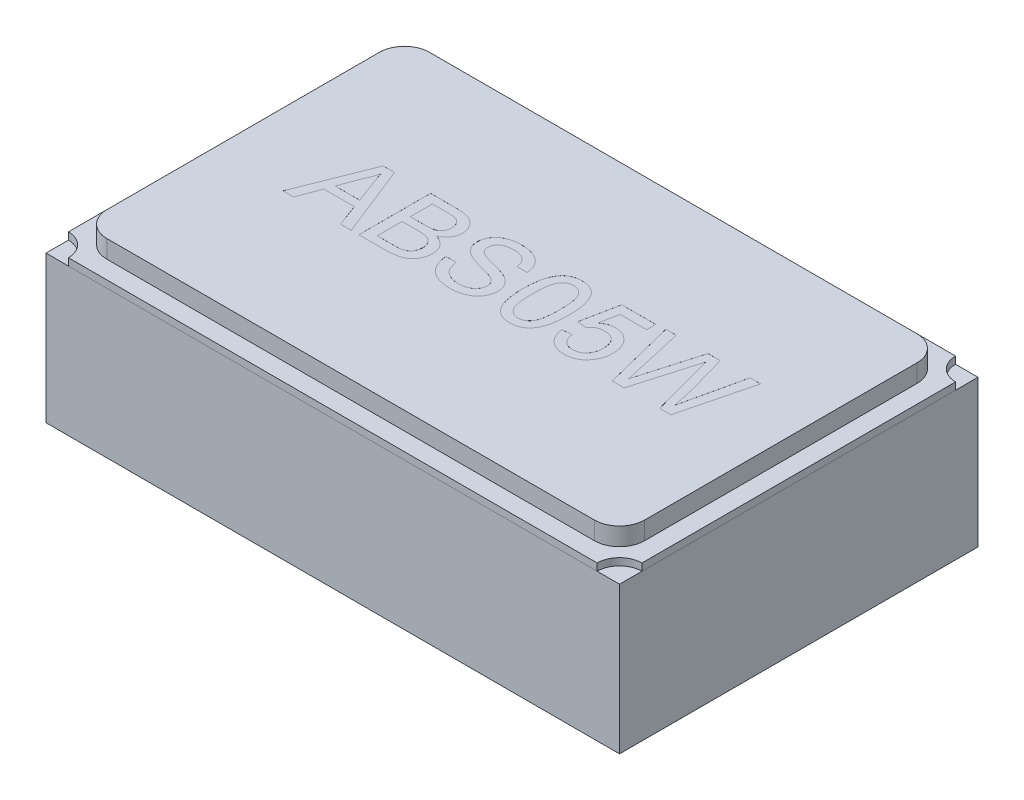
from build123d import *

# Parameters (mm, degrees)
SKETCH1_W           = 1.6
SKETCH1_H           = 1
BOSS_EXTRUDE1_DEPTH = 0.48
CUT_EXTRUDE1_START  = 0.48
SKETCH2_W           = 1.6
SKETCH2_H           = 1
SKETCH2_W_2         = 1.5
SKETCH2_H_2         = 0.9
CUT_EXTRUDE1_DEPTH  = 0.07
FILLET1_R           = 0.07
CUT_EXTRUDE2_START  = 0.48
CUT_EXTRUDE2_DEPTH  = 0.0001
SKETCH3_W           = 0.4
SKETCH3_H           = 0.86
BOSS_EXTRUDE4_DEPTH = 0.02
BOSS_EXTRUDE5_DEPTH = 0.02


with BuildPart() as part:
    # Sketch1 → Boss-Extrude1 (new body)
    with BuildSketch(Plane(origin=(0, 0, 0), x_dir=(1, 0, 0), z_dir=(0, 1, 0))):
        Rectangle(SKETCH1_W, SKETCH1_H)
    extrude(amount=BOSS_EXTRUDE1_DEPTH)

    # Sketch2 → Cut-Extrude1 (cut)
    with BuildSketch(Plane(origin=(0, 0, 0), x_dir=(1, 0, 0), z_dir=(0, 1, 0)).offset(CUT_EXTRUDE1_START)):
        Rectangle(SKETCH2_W, SKETCH2_H)
        Rectangle(SKETCH2_W_2, SKETCH2_H_2, mode=Mode.SUBTRACT)
    extrude(amount=-CUT_EXTRUDE1_DEPTH, mode=Mode.SUBTRACT)

    # Fillet1
    fillet1_edges = [part.edges().sort_by_distance(p)[0] for p in [
        (-0.75, 0.445, 0.45),
        (-0.75, 0.445, -0.45),
        (0.75, 0.445, -0.45),
        (0.75, 0.445, 0.45),
    ]]
    fillet(fillet1_edges, radius=FILLET1_R)

    # Sketch4 → Cut-Extrude2 (cut)
    # profile 1 of 6: a face of its own
    with BuildSketch(Plane(origin=(0, 0, 0), x_dir=(1, 0, 0), z_dir=(0, 1, 0)).offset(CUT_EXTRUDE2_START)):
        Polygon((-0.54989923, -0.089248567), (-0.470492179, 0.110751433), (-0.438681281, 0.110751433), (-0.35927423, -0.089248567), (-0.389202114, -0.089248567), (-0.411958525, -0.027710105), (-0.497214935, -0.027710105), (-0.519971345, -0.089248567), align=None)
        with BuildLine():
            Line((-0.488721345, -0.004633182), (-0.420452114, -0.004633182))
            Line((-0.420452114, -0.004633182), (-0.439883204, 0.047930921))
            add(Edge.make_bspline(
                [(-0.439883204, 0.047930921), (-0.440628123, 0.049961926), (-0.442084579, 0.053932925), (-0.444256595, 0.059702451), (-0.446240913, 0.06518143), (-0.4481867, 0.0702913), (-0.449943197, 0.075106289), (-0.451562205, 0.079593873), (-0.45316339, 0.08372286), (-0.454124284, 0.086390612), (-0.45458673, 0.08767451)],
                knots=[0, 0, 0, 0, 1.225184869, 2.395467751, 3.491410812, 4.525364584, 5.492066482, 6.394148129, 7.227157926, 8, 8, 8, 8], degree=3))
            add(Edge.make_bspline(
                [(-0.45458673, 0.08767451), (-0.455351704, 0.08450853), (-0.456884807, 0.078163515), (-0.460094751, 0.068867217), (-0.463766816, 0.059655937), (-0.46674897, 0.053720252), (-0.468248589, 0.050735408)],
                knots=[0, 0, 0, 0, 0.9891762, 1.982431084, 2.985436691, 4, 4, 4, 4], degree=3))
            Line((-0.468248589, 0.050735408), (-0.488721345, -0.004633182))
        make_face(mode=Mode.SUBTRACT)
    # profile 2 of 6: a face of its own
    with BuildSketch(Plane(origin=(0, 0, 0), x_dir=(1, 0, 0), z_dir=(0, 1, 0)).offset(CUT_EXTRUDE2_START)):
        with BuildLine():
            Line((-0.337920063, -0.089248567), (-0.337920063, 0.110751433))
            Line((-0.337920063, 0.110751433), (-0.263040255, 0.110751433))
            add(Edge.make_bspline(
                [(-0.263040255, 0.110751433), (-0.26118336, 0.11074431), (-0.257560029, 0.11073041), (-0.252269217, 0.110382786), (-0.247258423, 0.109907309), (-0.24251686, 0.109294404), (-0.238065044, 0.108405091), (-0.233907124, 0.107327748), (-0.230021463, 0.106085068), (-0.225271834, 0.104192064), (-0.219798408, 0.101278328), (-0.213935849, 0.096930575), (-0.208835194, 0.091710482), (-0.204638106, 0.08572535), (-0.201180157, 0.079332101), (-0.198728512, 0.072652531), (-0.197161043, 0.065832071), (-0.196983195, 0.061213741), (-0.196894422, 0.058908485)],
                knots=[0, 0, 0, 0, 0.939712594, 1.833646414, 2.682508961, 3.487467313, 4.25240329, 4.978730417, 5.660668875, 6.315918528, 7.564895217, 8.787077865, 9.996481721, 11.241996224, 12.475862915, 13.665015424, 14.834484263, 16, 16, 16, 16], degree=3))
            add(Edge.make_bspline(
                [(-0.196894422, 0.058908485), (-0.196987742, 0.056763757), (-0.197173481, 0.052494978), (-0.198651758, 0.046206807), (-0.200984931, 0.040101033), (-0.204284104, 0.034251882), (-0.20850086, 0.028766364), (-0.213728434, 0.023830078), (-0.219891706, 0.019432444), (-0.224517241, 0.017088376), (-0.226902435, 0.015879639)],
                knots=[0, 0, 0, 0, 0.926741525, 1.844548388, 2.778836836, 3.746021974, 4.738420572, 5.759761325, 6.844803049, 8, 8, 8, 8], degree=3))
            add(Edge.make_bspline(
                [(-0.226902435, 0.015879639), (-0.225426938, 0.015417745), (-0.222538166, 0.014513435), (-0.218385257, 0.012858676), (-0.214486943, 0.010974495), (-0.210834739, 0.008857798), (-0.207453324, 0.006488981), (-0.204352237, 0.003864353), (-0.201509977, 0.001024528), (-0.198931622, -0.002028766), (-0.196666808, -0.00527588), (-0.194635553, -0.008645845), (-0.192958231, -0.012179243), (-0.191583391, -0.015866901), (-0.190510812, -0.019686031), (-0.189740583, -0.023651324), (-0.189301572, -0.027753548), (-0.189235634, -0.030540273), (-0.189202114, -0.0319569)],
                knots=[0, 0, 0, 0, 1.127427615, 2.20731145, 3.257257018, 4.283066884, 5.282973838, 6.264540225, 7.242620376, 8.210460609, 9.17525685, 10.12748095, 11.077310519, 12.023587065, 12.994999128, 13.967387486, 14.966724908, 16, 16, 16, 16], degree=3))
            add(Edge.make_bspline(
                [(-0.189202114, -0.0319569), (-0.189271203, -0.034231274), (-0.189408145, -0.038739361), (-0.190507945, -0.045374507), (-0.192366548, -0.051756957), (-0.194924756, -0.057783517), (-0.197972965, -0.063355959), (-0.201437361, -0.068328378), (-0.205229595, -0.072649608), (-0.209456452, -0.076284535), (-0.214090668, -0.079369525), (-0.219263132, -0.081967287), (-0.224933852, -0.084258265), (-0.231218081, -0.086088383), (-0.23811296, -0.087542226), (-0.245712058, -0.08848679), (-0.25402705, -0.089162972), (-0.259820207, -0.089219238), (-0.262839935, -0.089248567)],
                knots=[0, 0, 0, 0, 1.028073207, 2.037766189, 3.031549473, 4.027532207, 4.992436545, 5.898794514, 6.762903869, 7.584966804, 8.412380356, 9.273953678, 10.198004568, 11.174406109, 12.229717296, 13.381036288, 14.634844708, 16, 16, 16, 16], degree=3))
            Line((-0.262839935, -0.089248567), (-0.337920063, -0.089248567))
        make_face()
        with BuildLine():
            Line((-0.309714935, 0.026136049), (-0.268488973, 0.026136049))
            add(Edge.make_bspline(
                [(-0.268488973, 0.026136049), (-0.267139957, 0.026141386), (-0.264548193, 0.02615164), (-0.260809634, 0.026294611), (-0.257359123, 0.026416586), (-0.254210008, 0.026722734), (-0.251346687, 0.027022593), (-0.248780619, 0.027426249), (-0.246499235, 0.027881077), (-0.245102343, 0.028302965), (-0.244450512, 0.028499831)],
                knots=[0, 0, 0, 0, 1.335841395, 2.566453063, 3.705076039, 4.753984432, 5.69893722, 6.555639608, 7.326018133, 8, 8, 8, 8], degree=3))
            add(Edge.make_bspline(
                [(-0.244450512, 0.028499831), (-0.242918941, 0.02903634), (-0.239966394, 0.030070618), (-0.236009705, 0.032419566), (-0.232639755, 0.035238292), (-0.229865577, 0.038576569), (-0.227733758, 0.04241653), (-0.226153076, 0.046678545), (-0.225287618, 0.051422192), (-0.225163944, 0.054711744), (-0.22509955, 0.05642451)],
                knots=[0, 0, 0, 0, 1.059015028, 2.041559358, 2.989777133, 3.920090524, 4.862499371, 5.848878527, 6.879979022, 8, 8, 8, 8], degree=3))
            add(Edge.make_bspline(
                [(-0.22509955, 0.05642451), (-0.225151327, 0.058070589), (-0.225252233, 0.061278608), (-0.226099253, 0.065937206), (-0.227564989, 0.070271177), (-0.229549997, 0.074279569), (-0.232063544, 0.077845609), (-0.235063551, 0.080911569), (-0.238657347, 0.083229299), (-0.24201647, 0.084675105), (-0.245037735, 0.085579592), (-0.247737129, 0.08611474), (-0.250799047, 0.086586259), (-0.254233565, 0.086987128), (-0.258041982, 0.08729824), (-0.262236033, 0.087545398), (-0.266805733, 0.087650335), (-0.269971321, 0.087666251), (-0.271613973, 0.08767451)],
                knots=[0, 0, 0, 0, 1.216168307, 2.37017178, 3.484610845, 4.588286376, 5.664695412, 6.69777344, 7.738183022, 8.803673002, 9.390844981, 10.0665252, 10.835811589, 11.680682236, 12.621801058, 13.660007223, 14.785756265, 16, 16, 16, 16], degree=3))
            Line((-0.271613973, 0.08767451), (-0.309714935, 0.08767451))
            Line((-0.309714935, 0.08767451), (-0.309714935, 0.026136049))
        make_face(mode=Mode.SUBTRACT)
        with BuildLine():
            Line((-0.309714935, -0.066171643), (-0.26239923, -0.066171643))
            add(Edge.make_bspline(
                [(-0.26239923, -0.066171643), (-0.260516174, -0.06615001), (-0.257056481, -0.066110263), (-0.252324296, -0.065985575), (-0.248499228, -0.065681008), (-0.246265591, -0.065353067), (-0.245291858, -0.065210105)],
                knots=[0, 0, 0, 0, 1.317581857, 2.420761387, 3.311546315, 4, 4, 4, 4], degree=3))
            add(Edge.make_bspline(
                [(-0.245291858, -0.065210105), (-0.243895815, -0.064916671), (-0.241192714, -0.064348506), (-0.23738199, -0.063080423), (-0.233888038, -0.061627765), (-0.230771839, -0.059781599), (-0.227886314, -0.057654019), (-0.225378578, -0.054996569), (-0.223068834, -0.051977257), (-0.221067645, -0.048521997), (-0.219449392, -0.044699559), (-0.21821259, -0.040569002), (-0.217553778, -0.036144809), (-0.217456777, -0.033107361), (-0.217407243, -0.031556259)],
                knots=[0, 0, 0, 0, 1.067651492, 2.067249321, 3.003744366, 3.895862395, 4.774133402, 5.679610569, 6.621910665, 7.616993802, 8.661192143, 9.724711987, 10.838102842, 12, 12, 12, 12], degree=3))
            add(Edge.make_bspline(
                [(-0.217407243, -0.031556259), (-0.21746243, -0.029735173), (-0.21757005, -0.026183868), (-0.218593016, -0.021052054), (-0.220282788, -0.016292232), (-0.222661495, -0.011970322), (-0.225579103, -0.008083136), (-0.229109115, -0.004785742), (-0.233225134, -0.002169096), (-0.237939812, -0.000115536), (-0.243450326, 0.001345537), (-0.24990881, 0.002336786), (-0.25741857, 0.002976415), (-0.262785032, 0.003030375), (-0.265644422, 0.003059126)],
                knots=[0, 0, 0, 0, 0.96167883, 1.875371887, 2.752872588, 3.621584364, 4.472914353, 5.312011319, 6.159851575, 7.038572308, 8.019870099, 9.164119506, 10.488969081, 12, 12, 12, 12], degree=3))
            Line((-0.265644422, 0.003059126), (-0.309714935, 0.003059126))
            Line((-0.309714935, 0.003059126), (-0.309714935, -0.066171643))
        make_face(mode=Mode.SUBTRACT)
    # profile 3 of 6: a face of its own
    with BuildSketch(Plane(origin=(0, 0, 0), x_dir=(1, 0, 0), z_dir=(0, 1, 0)).offset(CUT_EXTRUDE2_START)):
        with BuildLine():
            Line((-0.163561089, -0.020017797), (-0.135355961, -0.020017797))
            add(Edge.make_bspline(
                [(-0.135355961, -0.020017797), (-0.135045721, -0.02255023), (-0.134449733, -0.02741517), (-0.132783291, -0.034310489), (-0.130638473, -0.040510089), (-0.12796609, -0.046096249), (-0.124450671, -0.051001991), (-0.120215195, -0.055426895), (-0.115071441, -0.059258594), (-0.109265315, -0.062668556), (-0.102798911, -0.065345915), (-0.095895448, -0.067330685), (-0.08858785, -0.068506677), (-0.083584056, -0.068658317), (-0.081029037, -0.068735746)],
                knots=[0, 0, 0, 0, 1.125557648, 2.162256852, 3.1243583, 4.018160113, 4.88511607, 5.777380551, 6.711250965, 7.707237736, 8.743031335, 9.791730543, 10.872421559, 12, 12, 12, 12], degree=3))
            add(Edge.make_bspline(
                [(-0.081029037, -0.068735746), (-0.078768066, -0.068693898), (-0.074359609, -0.068612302), (-0.067982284, -0.067632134), (-0.061981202, -0.066241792), (-0.05646805, -0.064138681), (-0.051463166, -0.061584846), (-0.047116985, -0.058495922), (-0.043406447, -0.055012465), (-0.040500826, -0.051042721), (-0.038218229, -0.046883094), (-0.036543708, -0.042607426), (-0.03554623, -0.03823945), (-0.035419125, -0.03530045), (-0.035355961, -0.033839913)],
                knots=[0, 0, 0, 0, 1.267006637, 2.470417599, 3.611360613, 4.716023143, 5.771382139, 6.754486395, 7.697536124, 8.612899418, 9.501261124, 10.352596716, 11.181322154, 12, 12, 12, 12], degree=3))
            add(Edge.make_bspline(
                [(-0.035355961, -0.033839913), (-0.035423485, -0.03239417), (-0.035555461, -0.029568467), (-0.036415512, -0.025454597), (-0.038050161, -0.021689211), (-0.040171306, -0.018118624), (-0.043122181, -0.014854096), (-0.046850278, -0.011846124), (-0.051437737, -0.009119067), (-0.054861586, -0.007625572), (-0.056670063, -0.006836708)],
                knots=[0, 0, 0, 0, 0.942140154, 1.841411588, 2.718743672, 3.605002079, 4.535543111, 5.568170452, 6.715506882, 8, 8, 8, 8], degree=3))
            add(Edge.make_bspline(
                [(-0.056670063, -0.006836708), (-0.057374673, -0.006547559), (-0.058966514, -0.00589432), (-0.061694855, -0.005029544), (-0.064932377, -0.0039113), (-0.068756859, -0.002759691), (-0.073147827, -0.00154145), (-0.078097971, -0.000162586), (-0.083604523, 0.001303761), (-0.08951131, 0.002864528), (-0.095475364, 0.004451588), (-0.101173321, 0.006040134), (-0.106415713, 0.007652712), (-0.111245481, 0.009205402), (-0.115637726, 0.010764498), (-0.119604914, 0.012287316), (-0.123151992, 0.013742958), (-0.125318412, 0.01481327), (-0.126341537, 0.015318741)],
                knots=[0, 0, 0, 0, 0.499201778, 1.127787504, 1.87543728, 2.745208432, 3.745951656, 4.863402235, 6.114490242, 7.482339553, 8.869366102, 10.161191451, 11.360587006, 12.46547846, 13.487450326, 14.41601931, 15.251940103, 16, 16, 16, 16], degree=3))
            add(Edge.make_bspline(
                [(-0.126341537, 0.015318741), (-0.128695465, 0.016590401), (-0.133239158, 0.019045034), (-0.139354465, 0.023433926), (-0.144507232, 0.028304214), (-0.14867572, 0.033648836), (-0.151942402, 0.039377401), (-0.154146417, 0.045499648), (-0.155655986, 0.051904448), (-0.155797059, 0.056308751), (-0.155868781, 0.058547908)],
                knots=[0, 0, 0, 0, 1.158441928, 2.236094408, 3.251151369, 4.220012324, 5.163146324, 6.095083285, 7.031536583, 8, 8, 8, 8], degree=3))
            add(Edge.make_bspline(
                [(-0.155868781, 0.058547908), (-0.155773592, 0.061027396), (-0.155584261, 0.065959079), (-0.153904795, 0.073196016), (-0.151226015, 0.080159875), (-0.148176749, 0.085688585), (-0.145203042, 0.089869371), (-0.142737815, 0.092880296), (-0.139972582, 0.095663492), (-0.136992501, 0.098257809), (-0.1337443, 0.100624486), (-0.130308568, 0.102860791), (-0.126560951, 0.104782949), (-0.12129499, 0.107229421), (-0.114250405, 0.109672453), (-0.105382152, 0.111801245), (-0.096048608, 0.113054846), (-0.089686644, 0.11322741), (-0.086437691, 0.113315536)],
                knots=[0, 0, 0, 0, 1.199927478, 2.386647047, 3.578628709, 4.806592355, 5.433127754, 6.062729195, 6.689531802, 7.331674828, 7.974827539, 8.635320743, 9.315455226, 10.01318112, 11.447700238, 12.918145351, 14.426146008, 16, 16, 16, 16], degree=3))
            add(Edge.make_bspline(
                [(-0.086437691, 0.113315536), (-0.082881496, 0.113234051), (-0.0759569, 0.113075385), (-0.065895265, 0.111755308), (-0.056510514, 0.109488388), (-0.04915067, 0.1069508), (-0.043709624, 0.104381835), (-0.039844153, 0.102377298), (-0.036256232, 0.100059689), (-0.032913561, 0.097551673), (-0.029785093, 0.094854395), (-0.026951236, 0.091903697), (-0.024288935, 0.088800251), (-0.021160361, 0.084344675), (-0.017787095, 0.078447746), (-0.014870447, 0.070808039), (-0.012866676, 0.062744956), (-0.012476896, 0.05717074), (-0.012279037, 0.054341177)],
                knots=[0, 0, 0, 0, 1.607600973, 3.130308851, 4.577334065, 5.967726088, 6.640410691, 7.296826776, 7.935019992, 8.569057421, 9.185393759, 9.8003086, 10.417295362, 11.032210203, 12.259799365, 13.477607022, 14.719591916, 16, 16, 16, 16], degree=3))
            Line((-0.012279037, 0.054341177), (-0.040484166, 0.054341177))
            add(Edge.make_bspline(
                [(-0.040484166, 0.054341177), (-0.040663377, 0.055773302), (-0.04101404, 0.058575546), (-0.041883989, 0.062632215), (-0.043103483, 0.066399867), (-0.044531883, 0.069913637), (-0.046263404, 0.073136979), (-0.048281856, 0.076100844), (-0.050611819, 0.078770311), (-0.053193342, 0.08121592), (-0.05610498, 0.083345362), (-0.059331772, 0.085193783), (-0.062879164, 0.086755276), (-0.066744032, 0.088034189), (-0.07092714, 0.089025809), (-0.075438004, 0.089755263), (-0.080274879, 0.090128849), (-0.08360596, 0.09020138), (-0.085315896, 0.090238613)],
                knots=[0, 0, 0, 0, 1.074487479, 2.102453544, 3.083708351, 4.020042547, 4.923259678, 5.803182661, 6.684453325, 7.556870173, 8.445961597, 9.363679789, 10.320905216, 11.327237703, 12.390948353, 13.519046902, 14.726457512, 16, 16, 16, 16], degree=3))
            add(Edge.make_bspline(
                [(-0.085315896, 0.090238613), (-0.087093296, 0.090225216), (-0.090533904, 0.090199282), (-0.095507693, 0.089726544), (-0.100117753, 0.089077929), (-0.104356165, 0.088121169), (-0.108209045, 0.086868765), (-0.111733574, 0.085422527), (-0.114831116, 0.083589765), (-0.117573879, 0.081548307), (-0.11993986, 0.079289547), (-0.121978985, 0.076909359), (-0.123782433, 0.074477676), (-0.125183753, 0.071861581), (-0.126324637, 0.069160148), (-0.127060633, 0.0663226), (-0.127581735, 0.063401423), (-0.12763597, 0.061408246), (-0.127663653, 0.060390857)],
                knots=[0, 0, 0, 0, 1.464176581, 2.834285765, 4.113735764, 5.29917439, 6.409476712, 7.449999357, 8.431575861, 9.367089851, 10.262376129, 11.120706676, 11.948504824, 12.751342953, 13.560717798, 14.359016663, 15.162382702, 16, 16, 16, 16], degree=3))
            add(Edge.make_bspline(
                [(-0.127663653, 0.060390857), (-0.127590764, 0.058670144), (-0.127449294, 0.055330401), (-0.126004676, 0.050585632), (-0.123782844, 0.046260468), (-0.121593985, 0.043907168), (-0.120492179, 0.042722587)],
                knots=[0, 0, 0, 0, 1.050964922, 2.039826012, 3.013306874, 4, 4, 4, 4], degree=3))
            add(Edge.make_bspline(
                [(-0.120492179, 0.042722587), (-0.119797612, 0.04213059), (-0.11826162, 0.040821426), (-0.11540367, 0.0390889), (-0.111860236, 0.037338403), (-0.107607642, 0.035598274), (-0.102653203, 0.033847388), (-0.097004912, 0.032044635), (-0.090641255, 0.030254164), (-0.083756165, 0.028528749), (-0.076800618, 0.026796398), (-0.07019051, 0.025070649), (-0.064121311, 0.023435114), (-0.058602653, 0.021839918), (-0.053628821, 0.020289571), (-0.049217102, 0.018751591), (-0.045331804, 0.017337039), (-0.0429516, 0.016341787), (-0.041846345, 0.015879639)],
                knots=[0, 0, 0, 0, 0.523891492, 1.158553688, 1.913783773, 2.794766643, 3.797521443, 4.933638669, 6.202080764, 7.596537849, 9.013317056, 10.322179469, 11.523240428, 12.626146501, 13.623953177, 14.517289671, 15.311498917, 16, 16, 16, 16], degree=3))
            add(Edge.make_bspline(
                [(-0.041846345, 0.015879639), (-0.040408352, 0.015216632), (-0.037585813, 0.01391526), (-0.033587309, 0.011693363), (-0.02985627, 0.009386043), (-0.026422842, 0.006931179), (-0.023298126, 0.004323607), (-0.020447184, 0.001593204), (-0.017852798, -0.001244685), (-0.015619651, -0.004280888), (-0.013614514, -0.007392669), (-0.011859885, -0.010623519), (-0.010447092, -0.013992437), (-0.009207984, -0.017458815), (-0.00831671, -0.021061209), (-0.007617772, -0.024763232), (-0.007210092, -0.028582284), (-0.007170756, -0.031168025), (-0.007150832, -0.032477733)],
                knots=[0, 0, 0, 0, 1.198900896, 2.353241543, 3.461831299, 4.520043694, 5.547003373, 6.541368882, 7.508191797, 8.454912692, 9.392021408, 10.310662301, 11.235020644, 12.156274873, 13.095836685, 14.042125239, 15.00831306, 16, 16, 16, 16], degree=3))
            add(Edge.make_bspline(
                [(-0.007150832, -0.032477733), (-0.007255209, -0.035091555), (-0.00746243, -0.040280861), (-0.009246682, -0.047930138), (-0.012049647, -0.055342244), (-0.015336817, -0.061224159), (-0.018444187, -0.065717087), (-0.021054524, -0.068946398), (-0.023949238, -0.071932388), (-0.027057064, -0.074768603), (-0.030402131, -0.077397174), (-0.03401264, -0.079818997), (-0.037850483, -0.082059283), (-0.043330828, -0.084789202), (-0.050609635, -0.087644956), (-0.059881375, -0.090023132), (-0.069652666, -0.091565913), (-0.076362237, -0.09172928), (-0.07978705, -0.091812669)],
                knots=[0, 0, 0, 0, 1.197055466, 2.376552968, 3.581957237, 4.820753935, 5.454298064, 6.085440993, 6.72202542, 7.359198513, 8.013298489, 8.67051481, 9.351020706, 10.049282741, 11.476266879, 12.925760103, 14.430794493, 16, 16, 16, 16], degree=3))
            add(Edge.make_bspline(
                [(-0.07978705, -0.091812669), (-0.081964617, -0.091794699), (-0.08623016, -0.091759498), (-0.092497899, -0.0913332), (-0.098504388, -0.090716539), (-0.104243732, -0.089798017), (-0.109697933, -0.088592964), (-0.11488657, -0.08714593), (-0.119821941, -0.085479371), (-0.124486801, -0.083519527), (-0.128868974, -0.081242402), (-0.133047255, -0.078785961), (-0.136953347, -0.076001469), (-0.140595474, -0.072932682), (-0.144065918, -0.069668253), (-0.147220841, -0.066074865), (-0.150167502, -0.062257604), (-0.15283857, -0.058181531), (-0.155224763, -0.053899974), (-0.15737063, -0.049484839), (-0.159178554, -0.044904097), (-0.160635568, -0.040180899), (-0.161869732, -0.035346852), (-0.162725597, -0.030361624), (-0.163354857, -0.025240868), (-0.163491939, -0.021769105), (-0.163561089, -0.020017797)],
                knots=[0, 0, 0, 0, 1.259822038, 2.467811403, 3.633536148, 4.752793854, 5.829021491, 6.863980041, 7.868367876, 8.841470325, 9.788447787, 10.724101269, 11.643985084, 12.560193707, 13.478453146, 14.398077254, 15.323914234, 16.266973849, 17.21495974, 18.158525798, 19.105629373, 20.061269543, 21.017128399, 21.990322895, 22.986232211, 24, 24, 24, 24], degree=3))
        make_face()
    # profile 4 of 6: a face of its own
    with BuildSketch(Plane(origin=(0, 0, 0), x_dir=(1, 0, 0), z_dir=(0, 1, 0)).offset(CUT_EXTRUDE2_START)):
        with BuildLine():
            add(Edge.make_bspline(
                [(0.021054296, 0.009389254), (0.021080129, 0.012247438), (0.021130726, 0.017845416), (0.02144456, 0.026036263), (0.02199249, 0.033814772), (0.022810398, 0.041174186), (0.023778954, 0.048131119), (0.025038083, 0.05467564), (0.026454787, 0.060822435), (0.028154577, 0.066565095), (0.03002209, 0.071952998), (0.032140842, 0.0769775), (0.034524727, 0.081633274), (0.037056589, 0.085968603), (0.039869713, 0.089916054), (0.042794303, 0.09358641), (0.046042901, 0.096845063), (0.049480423, 0.09977586), (0.053157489, 0.102362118), (0.057054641, 0.104593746), (0.061156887, 0.106564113), (0.065542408, 0.108047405), (0.070120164, 0.109256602), (0.074925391, 0.110146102), (0.079963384, 0.110670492), (0.083406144, 0.110724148), (0.08515686, 0.110751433)],
                knots=[0, 0, 0, 0, 1.514747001, 2.966751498, 4.343369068, 5.64627492, 6.890416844, 8.064737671, 9.177176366, 10.232018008, 11.237056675, 12.19799043, 13.119080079, 14.007588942, 14.855863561, 15.685992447, 16.491747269, 17.290132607, 18.077525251, 18.870243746, 19.668095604, 20.485086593, 21.319398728, 22.175900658, 23.072407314, 24, 24, 24, 24], degree=3))
            add(Edge.make_bspline(
                [(0.08515686, 0.110751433), (0.087725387, 0.110675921), (0.092771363, 0.110527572), (0.100138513, 0.109317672), (0.107081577, 0.107247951), (0.113596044, 0.104455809), (0.119570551, 0.10090925), (0.124906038, 0.096597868), (0.129544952, 0.091566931), (0.133436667, 0.085756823), (0.136838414, 0.079327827), (0.139860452, 0.072251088), (0.142592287, 0.064534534), (0.144530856, 0.057627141), (0.145913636, 0.051664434), (0.146828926, 0.046746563), (0.147588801, 0.041440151), (0.148170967, 0.035758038), (0.148648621, 0.029706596), (0.149017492, 0.023282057), (0.149204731, 0.016468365), (0.149240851, 0.011793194), (0.149259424, 0.009389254)],
                knots=[0, 0, 0, 0, 1.134486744, 2.228744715, 3.287356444, 4.328707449, 5.352829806, 6.347195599, 7.349461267, 8.364207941, 9.428085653, 10.559314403, 11.761222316, 13.04268526, 13.726896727, 14.465273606, 15.252205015, 16.094778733, 16.988606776, 17.934225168, 18.937792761, 20, 20, 20, 20], degree=3))
            add(Edge.make_bspline(
                [(0.149259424, 0.009389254), (0.149233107, 0.006544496), (0.149181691, 0.0009867), (0.148876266, -0.00713847), (0.14829532, -0.014858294), (0.147580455, -0.022190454), (0.146499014, -0.029115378), (0.145333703, -0.035662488), (0.143892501, -0.041802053), (0.142210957, -0.047536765), (0.140317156, -0.052896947), (0.13824031, -0.057923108), (0.135940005, -0.062611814), (0.133347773, -0.066917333), (0.130582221, -0.070896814), (0.127623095, -0.074565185), (0.124407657, -0.077869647), (0.120939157, -0.080791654), (0.11728791, -0.083423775), (0.113381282, -0.085677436), (0.109236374, -0.087544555), (0.104880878, -0.089140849), (0.100270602, -0.09031052), (0.095441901, -0.091205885), (0.090376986, -0.09173314), (0.086920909, -0.091785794), (0.08515686, -0.091812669)],
                knots=[0, 0, 0, 0, 1.508974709, 2.94807912, 4.311757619, 5.615040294, 6.854280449, 8.028314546, 9.141715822, 10.197470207, 11.196696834, 12.155719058, 13.080757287, 13.963948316, 14.818758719, 15.649605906, 16.461113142, 17.260189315, 18.052359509, 18.845763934, 19.647754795, 20.461145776, 21.303032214, 22.167241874, 23.064524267, 24, 24, 24, 24], degree=3))
            add(Edge.make_bspline(
                [(0.08515686, -0.091812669), (0.082843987, -0.091746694), (0.078334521, -0.091618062), (0.071748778, -0.090744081), (0.065567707, -0.089205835), (0.059739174, -0.087142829), (0.054328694, -0.084383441), (0.049310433, -0.081026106), (0.044583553, -0.077148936), (0.041862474, -0.074089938), (0.040485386, -0.072541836)],
                knots=[0, 0, 0, 0, 1.10322584, 2.150986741, 3.161425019, 4.136713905, 5.093944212, 6.049774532, 7.013026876, 8, 8, 8, 8], degree=3))
            add(Edge.make_bspline(
                [(0.040485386, -0.072541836), (0.038900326, -0.070255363), (0.035631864, -0.06554056), (0.031806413, -0.057501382), (0.028394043, -0.048651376), (0.025715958, -0.038816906), (0.02361835, -0.028076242), (0.022103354, -0.01640831), (0.021246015, -0.003818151), (0.021119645, 0.004887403), (0.021054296, 0.009389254)],
                knots=[0, 0, 0, 0, 0.779365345, 1.607084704, 2.489375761, 3.438383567, 4.461919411, 5.557722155, 6.737039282, 8, 8, 8, 8], degree=3))
        make_face()
        with BuildLine():
            add(Edge.make_bspline(
                [(0.046695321, 0.009469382), (0.046720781, 0.005622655), (0.046769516, -0.001740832), (0.04727868, -0.012260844), (0.048155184, -0.021751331), (0.04931398, -0.030199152), (0.05084406, -0.037615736), (0.052765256, -0.043982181), (0.0549309, -0.049374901), (0.057610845, -0.053727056), (0.060545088, -0.057274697), (0.063574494, -0.060325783), (0.066770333, -0.062919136), (0.070111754, -0.065081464), (0.073650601, -0.066718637), (0.077348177, -0.067905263), (0.081205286, -0.068588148), (0.083832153, -0.068686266), (0.08515686, -0.068735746)],
                knots=[0, 0, 0, 0, 1.89448813, 3.626469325, 5.185477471, 6.587276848, 7.82441448, 8.910550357, 9.859733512, 10.6775885, 11.416198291, 12.123144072, 12.791880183, 13.439617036, 14.078171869, 14.70637855, 15.347637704, 16, 16, 16, 16], degree=3))
            add(Edge.make_bspline(
                [(0.08515686, -0.068735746), (0.086481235, -0.068685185), (0.089107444, -0.068584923), (0.092973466, -0.067917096), (0.096656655, -0.066669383), (0.100190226, -0.065037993), (0.103555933, -0.062924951), (0.106736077, -0.060321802), (0.109781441, -0.057272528), (0.112702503, -0.053683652), (0.11536203, -0.049311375), (0.1175683, -0.043923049), (0.119459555, -0.037545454), (0.120998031, -0.030132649), (0.122161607, -0.021698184), (0.123032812, -0.01223402), (0.123545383, -0.001727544), (0.123593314, 0.005622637), (0.123618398, 0.009469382)],
                knots=[0, 0, 0, 0, 0.652509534, 1.29391342, 1.924290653, 2.562989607, 3.207355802, 3.876242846, 4.583348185, 5.32723334, 6.150888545, 7.094226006, 8.186903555, 9.424320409, 10.81992305, 12.379283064, 14.105084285, 16, 16, 16, 16], degree=3))
            add(Edge.make_bspline(
                [(0.123618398, 0.009469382), (0.123594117, 0.013236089), (0.123547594, 0.020452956), (0.123021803, 0.030770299), (0.122197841, 0.040101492), (0.121070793, 0.048455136), (0.119572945, 0.055822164), (0.11775626, 0.062218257), (0.115591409, 0.067629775), (0.113017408, 0.072111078), (0.11015203, 0.075786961), (0.107158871, 0.078968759), (0.103963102, 0.081674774), (0.100508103, 0.083845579), (0.096905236, 0.085596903), (0.093071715, 0.08680221), (0.089045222, 0.087542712), (0.086281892, 0.087630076), (0.084876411, 0.08767451)],
                knots=[0, 0, 0, 0, 1.850066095, 3.544656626, 5.0727657, 6.45041401, 7.682899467, 8.762389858, 9.712573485, 10.538438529, 11.291566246, 11.996865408, 12.681389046, 13.341983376, 13.996294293, 14.643563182, 15.31009126, 16, 16, 16, 16], degree=3))
            add(Edge.make_bspline(
                [(0.084876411, 0.08767451), (0.083551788, 0.087639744), (0.0809398, 0.08757119), (0.077115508, 0.086916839), (0.073491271, 0.085822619), (0.070025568, 0.084340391), (0.066804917, 0.082345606), (0.063701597, 0.080016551), (0.060860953, 0.077178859), (0.059149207, 0.075057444), (0.058273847, 0.073972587)],
                knots=[0, 0, 0, 0, 1.021318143, 2.013908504, 2.982026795, 3.937174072, 4.91255697, 5.897578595, 6.924855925, 8, 8, 8, 8], degree=3))
            add(Edge.make_bspline(
                [(0.058273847, 0.073972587), (0.057320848, 0.072379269), (0.055308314, 0.069014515), (0.053056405, 0.063166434), (0.051067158, 0.056483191), (0.049429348, 0.048861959), (0.048244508, 0.040315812), (0.047309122, 0.030854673), (0.046823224, 0.020465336), (0.046739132, 0.013235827), (0.046695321, 0.009469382)],
                knots=[0, 0, 0, 0, 0.671104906, 1.417232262, 2.260109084, 3.195198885, 4.23592645, 5.382417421, 6.636286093, 8, 8, 8, 8], degree=3))
        make_face(mode=Mode.SUBTRACT)
    # profile 5 of 6: a face of its own
    with BuildSketch(Plane(origin=(0, 0, 0), x_dir=(1, 0, 0), z_dir=(0, 1, 0)).offset(CUT_EXTRUDE2_START)):
        with BuildLine():
            Line((0.17490045, -0.035402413), (0.200541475, -0.03283831))
            add(Edge.make_bspline(
                [(0.200541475, -0.03283831), (0.200795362, -0.034283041), (0.20128921, -0.037093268), (0.202230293, -0.041161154), (0.203452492, -0.044940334), (0.204825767, -0.048463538), (0.206458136, -0.051693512), (0.208226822, -0.054681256), (0.210312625, -0.057320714), (0.212505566, -0.059749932), (0.214912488, -0.061890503), (0.217556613, -0.063695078), (0.22036417, -0.06526946), (0.223369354, -0.066558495), (0.22657677, -0.067502), (0.229945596, -0.068248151), (0.233519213, -0.068624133), (0.235957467, -0.068698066), (0.237200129, -0.068735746)],
                knots=[0, 0, 0, 0, 1.237781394, 2.407677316, 3.51963579, 4.58689595, 5.594855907, 6.570874, 7.510833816, 8.428091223, 9.330271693, 10.221190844, 11.124215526, 12.043132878, 12.973586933, 13.941700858, 14.950982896, 16, 16, 16, 16], degree=3))
            add(Edge.make_bspline(
                [(0.237200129, -0.068735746), (0.238724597, -0.06869891), (0.241705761, -0.068626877), (0.246042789, -0.068017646), (0.250139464, -0.067013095), (0.253976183, -0.0656073), (0.257597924, -0.063859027), (0.260884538, -0.061595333), (0.26401523, -0.059050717), (0.266788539, -0.056017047), (0.269313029, -0.052714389), (0.271491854, -0.049109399), (0.273326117, -0.045252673), (0.274870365, -0.041144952), (0.27601068, -0.03676277), (0.276849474, -0.032129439), (0.277387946, -0.027242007), (0.277438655, -0.023892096), (0.277464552, -0.022181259)],
                knots=[0, 0, 0, 0, 1.052816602, 2.058828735, 3.018813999, 3.961574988, 4.877590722, 5.788574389, 6.712363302, 7.658909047, 8.620312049, 9.580784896, 10.562948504, 11.56722449, 12.607883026, 13.686460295, 14.818448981, 16, 16, 16, 16], degree=3))
            add(Edge.make_bspline(
                [(0.277464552, -0.022181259), (0.277435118, -0.020550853), (0.277377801, -0.017376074), (0.276895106, -0.012753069), (0.276080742, -0.008406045), (0.275027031, -0.00428709), (0.273574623, -0.000460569), (0.271851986, 0.003129), (0.269741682, 0.006405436), (0.267393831, 0.009470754), (0.264712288, 0.012218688), (0.261660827, 0.01453897), (0.258359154, 0.016569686), (0.25474077, 0.01821647), (0.250803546, 0.019439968), (0.246586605, 0.02038134), (0.242046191, 0.020876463), (0.238923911, 0.020963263), (0.237320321, 0.021007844)],
                knots=[0, 0, 0, 0, 1.165854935, 2.270189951, 3.319242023, 4.32700288, 5.306253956, 6.24172124, 7.169108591, 8.088047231, 8.999810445, 9.905349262, 10.822648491, 11.767237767, 12.739852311, 13.766490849, 14.852878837, 16, 16, 16, 16], degree=3))
            add(Edge.make_bspline(
                [(0.237320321, 0.021007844), (0.235326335, 0.020949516), (0.231502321, 0.020837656), (0.226007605, 0.019896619), (0.221005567, 0.018376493), (0.216552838, 0.01611093), (0.212574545, 0.013404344), (0.208988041, 0.010341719), (0.205763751, 0.006925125), (0.203995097, 0.004352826), (0.203105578, 0.003059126)],
                knots=[0, 0, 0, 0, 1.182877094, 2.268490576, 3.298955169, 4.273890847, 5.221533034, 6.149304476, 7.069219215, 8, 8, 8, 8], degree=3))
            Line((0.203105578, 0.003059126), (0.177464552, 0.005623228))
            Line((0.177464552, 0.005623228), (0.197977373, 0.108187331))
            Line((0.197977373, 0.108187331), (0.292849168, 0.108187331))
            Line((0.292849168, 0.108187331), (0.292849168, 0.082546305))
            Line((0.292849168, 0.082546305), (0.218930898, 0.082546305))
            Line((0.218930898, 0.082546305), (0.208754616, 0.030743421))
            add(Edge.make_bspline(
                [(0.208754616, 0.030743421), (0.210169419, 0.031805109), (0.212947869, 0.033890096), (0.217281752, 0.036620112), (0.221677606, 0.038921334), (0.226109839, 0.040805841), (0.230613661, 0.042273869), (0.235161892, 0.043293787), (0.239770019, 0.043983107), (0.24286004, 0.044050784), (0.244411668, 0.044084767)],
                knots=[0, 0, 0, 0, 1.093835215, 2.148119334, 3.164235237, 4.159999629, 5.123971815, 6.089888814, 7.040853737, 8, 8, 8, 8], degree=3))
            add(Edge.make_bspline(
                [(0.244411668, 0.044084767), (0.246431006, 0.044031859), (0.250407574, 0.043927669), (0.256267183, 0.043071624), (0.261869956, 0.041618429), (0.267259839, 0.039661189), (0.272365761, 0.037066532), (0.277239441, 0.033924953), (0.281861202, 0.030210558), (0.286204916, 0.025993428), (0.290144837, 0.021311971), (0.293671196, 0.016318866), (0.296551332, 0.010914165), (0.298973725, 0.005238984), (0.300800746, -0.000799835), (0.302187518, -0.00711659), (0.302928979, -0.013790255), (0.30304579, -0.018333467), (0.303105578, -0.020658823)],
                knots=[0, 0, 0, 0, 0.991958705, 1.953407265, 2.902004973, 3.832128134, 4.765371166, 5.71007953, 6.676509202, 7.674246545, 8.68000108, 9.679398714, 10.671856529, 11.683459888, 12.706765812, 13.76733029, 14.85725088, 16, 16, 16, 16], degree=3))
            add(Edge.make_bspline(
                [(0.303105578, -0.020658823), (0.303060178, -0.022877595), (0.3029705, -0.027260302), (0.302235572, -0.033719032), (0.301024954, -0.039942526), (0.299404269, -0.045949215), (0.297214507, -0.051704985), (0.29455853, -0.057228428), (0.291494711, -0.062577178), (0.289037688, -0.065874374), (0.287801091, -0.067533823)],
                knots=[0, 0, 0, 0, 1.059692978, 2.093196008, 3.100373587, 4.086253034, 5.061402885, 6.037282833, 7.012182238, 8, 8, 8, 8], degree=3))
            add(Edge.make_bspline(
                [(0.287801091, -0.067533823), (0.286230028, -0.069470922), (0.28313958, -0.073281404), (0.277788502, -0.078227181), (0.272036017, -0.082430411), (0.265847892, -0.085845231), (0.259265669, -0.088589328), (0.252208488, -0.090415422), (0.244761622, -0.091641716), (0.239649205, -0.091754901), (0.237039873, -0.091812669)],
                knots=[0, 0, 0, 0, 1.023140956, 2.012628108, 2.982342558, 3.942221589, 4.908720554, 5.902469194, 6.929439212, 8, 8, 8, 8], degree=3))
            add(Edge.make_bspline(
                [(0.237039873, -0.091812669), (0.234887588, -0.09176901), (0.230677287, -0.091683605), (0.224512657, -0.090941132), (0.218649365, -0.08975715), (0.213085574, -0.088058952), (0.207804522, -0.08591312), (0.202867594, -0.083187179), (0.198189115, -0.080068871), (0.193871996, -0.076462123), (0.189938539, -0.072439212), (0.186414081, -0.068085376), (0.183346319, -0.063397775), (0.180736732, -0.058404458), (0.178561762, -0.053110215), (0.176897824, -0.04747891), (0.175579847, -0.041565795), (0.17512929, -0.037478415), (0.17490045, -0.035402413)],
                knots=[0, 0, 0, 0, 1.108768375, 2.168973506, 3.19473529, 4.187459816, 5.162590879, 6.12651078, 7.088512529, 8.056012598, 9.019588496, 9.983680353, 10.938070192, 11.90157236, 12.88306954, 13.882379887, 14.924449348, 16, 16, 16, 16], degree=3))
        make_face()
    # profile 6 of 6: a face of its own
    with BuildSketch(Plane(origin=(0, 0, 0), x_dir=(1, 0, 0), z_dir=(0, 1, 0)).offset(CUT_EXTRUDE2_START)):
        with BuildLine():
            Line((0.36885077, -0.089248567), (0.318490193, 0.110751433))
            Line((0.318490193, 0.110751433), (0.347616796, 0.110751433))
            Line((0.347616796, 0.110751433), (0.377304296, -0.020779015))
            add(Edge.make_bspline(
                [(0.377304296, -0.020779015), (0.378842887, -0.027562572), (0.381904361, -0.04106043), (0.384932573, -0.05456579), (0.386438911, -0.061283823)],
                knots=[0, 0, 0, 0, 1.00513078, 2, 2, 2, 2], degree=3))
            add(Edge.make_bspline(
                [(0.386438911, -0.061283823), (0.387152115, -0.058868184), (0.388498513, -0.054307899), (0.390318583, -0.047843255), (0.391971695, -0.042201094), (0.393380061, -0.037355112), (0.394520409, -0.033298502), (0.395504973, -0.03008111), (0.396176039, -0.027639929), (0.396573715, -0.026294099), (0.396735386, -0.025746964)],
                knots=[0, 0, 0, 0, 1.633809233, 3.084334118, 4.356383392, 5.447555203, 6.357852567, 7.089694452, 7.629924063, 8, 8, 8, 8], degree=3))
            Line((0.396735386, -0.025746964), (0.436238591, 0.110751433))
            Line((0.436238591, 0.110751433), (0.470172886, 0.110751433))
            Line((0.470172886, 0.110751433), (0.498738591, 0.010551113))
            add(Edge.make_bspline(
                [(0.498738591, 0.010551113), (0.50031502, 0.00436113), (0.503423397, -0.007844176), (0.507553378, -0.026024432), (0.511365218, -0.043763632), (0.513560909, -0.055496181), (0.514644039, -0.061283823)],
                knots=[0, 0, 0, 0, 1.04154457, 2.053700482, 3.039894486, 4, 4, 4, 4], degree=3))
            add(Edge.make_bspline(
                [(0.514644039, -0.061283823), (0.515308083, -0.058318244), (0.516705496, -0.052077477), (0.518987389, -0.042249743), (0.521349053, -0.031443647), (0.523052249, -0.023929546), (0.523938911, -0.020017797)],
                knots=[0, 0, 0, 0, 0.862130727, 1.814268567, 2.86213528, 4, 4, 4, 4], degree=3))
            Line((0.523938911, -0.020017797), (0.553466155, 0.110751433))
            Line((0.553466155, 0.110751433), (0.582592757, 0.110751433))
            Line((0.582592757, 0.110751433), (0.532192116, -0.089248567))
            Line((0.532192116, -0.089248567), (0.501182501, -0.089248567))
            Line((0.501182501, -0.089248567), (0.459395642, 0.063595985))
            add(Edge.make_bspline(
                [(0.459395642, 0.063595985), (0.458976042, 0.065090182), (0.458178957, 0.067928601), (0.457134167, 0.071979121), (0.456098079, 0.075541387), (0.455273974, 0.078661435), (0.45456078, 0.081307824), (0.453929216, 0.083472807), (0.453523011, 0.085198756), (0.453229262, 0.086179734), (0.453105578, 0.08659278)],
                knots=[0, 0, 0, 0, 1.562239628, 2.967673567, 4.210417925, 5.296319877, 6.215971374, 6.969386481, 7.566055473, 8, 8, 8, 8], degree=3))
            add(Edge.make_bspline(
                [(0.453105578, 0.08659278), (0.452363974, 0.083973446), (0.450962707, 0.079024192), (0.448887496, 0.072056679), (0.447146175, 0.065930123), (0.44604266, 0.062139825), (0.445533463, 0.060390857)],
                knots=[0, 0, 0, 0, 1.197730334, 2.263121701, 3.198547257, 4, 4, 4, 4], degree=3))
            Line((0.445533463, 0.060390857), (0.402224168, -0.089248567))
            Line((0.402224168, -0.089248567), (0.36885077, -0.089248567))
        make_face()
    extrude(amount=-CUT_EXTRUDE2_DEPTH, mode=Mode.SUBTRACT)

    # Sketch3 → Boss-Extrude4 (add)
    with BuildSketch(Plane(origin=(0, 0, 0), x_dir=(1, 0, 0), z_dir=(0, 1, 0))):
        Polygon((-0.73, 0.43), (-0.53, 0.43), (-0.33, 0.23), (-0.33, -0.43), (-0.73, -0.43), align=None)
        with Locations((0.53, 0)):
            Rectangle(SKETCH3_W, SKETCH3_H)
    extrude(amount=-BOSS_EXTRUDE4_DEPTH)


with BuildPart() as body_2:
    # Sketch5 → Boss-Extrude5 (new body)
    with BuildSketch(Plane(origin=(0, 0.41, 0), x_dir=(-1, 0, 0), z_dir=(0, 1, 0))):
        with BuildLine():
            Line((-0.8, -0.4375), (-0.8, 0.4375))
            ThreePointArc((-0.8, 0.4375), (-0.755805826, 0.455805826), (-0.7375, 0.5))
            Line((-0.7375, 0.5), (0.7375, 0.5))
            ThreePointArc((0.7375, 0.5), (0.755805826, 0.455805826), (0.8, 0.4375))
            Line((0.8, 0.4375), (0.8, -0.4375))
            ThreePointArc((0.8, -0.4375), (0.755805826, -0.455805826), (0.7375, -0.5))
            Line((0.7375, -0.5), (-0.7375, -0.5))
            ThreePointArc((-0.7375, -0.5), (-0.755805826, -0.455805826), (-0.8, -0.4375))
        make_face()
        with BuildLine():
            Line((-0.75, -0.38), (-0.75, 0.38))
            ThreePointArc((-0.75, 0.38), (-0.729497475, 0.429497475), (-0.68, 0.45))
            Line((-0.68, 0.45), (0.68, 0.45))
            ThreePointArc((0.68, 0.45), (0.729497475, 0.429497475), (0.75, 0.38))
            Line((0.75, 0.38), (0.75, -0.38))
            ThreePointArc((0.75, -0.38), (0.729497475, -0.429497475), (0.68, -0.45))
            Line((0.68, -0.45), (-0.68, -0.45))
            ThreePointArc((-0.68, -0.45), (-0.729497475, -0.429497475), (-0.75, -0.38))
        make_face(mode=Mode.SUBTRACT)
    extrude(amount=BOSS_EXTRUDE5_DEPTH)


solid = Compound([part.part, body_2.part])
